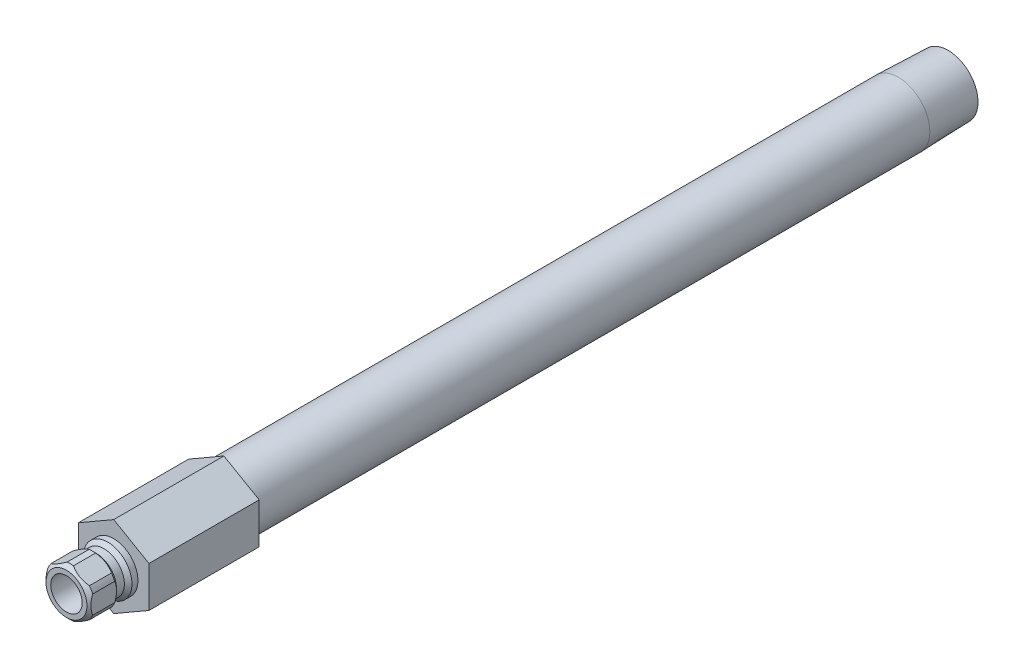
from build123d import *

# Parameters (mm, degrees)
SKETCH2_R           = 3.175
BOSS_EXTRUDE1_DEPTH = 22.225
CUT_EXTRUDE1_START  = 3.556
SKETCH3_OUTSIDE_W   = 52.048
SKETCH3_OUTSIDE_H   = 54.248
CUT_EXTRUDE1_DEPTH  = 166.069315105


with BuildPart() as part:
    # Sketch1 → Revolve1 (revolve)
    with BuildSketch(Plane(origin=(0, 0, 0), x_dir=(0, 0, -1), z_dir=(1, 0, 0))):
        Polygon((-9.525, 3.175), (-9.525, 4.1275), (-8.763, 4.8895), (-4.318, 4.8895), (-3.556, 4.1275), (-1.9685, 4.1275), (-1.2065, 4.8895), (0, 4.8895), (0, 6.35), (158.242, 6.35), (168.275, 6.036470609), (168.275, 4.6228), (22.225, 4.6228), (22.225, 3.175), align=None)
    revolve(axis=Axis((0, 0, 0), (0, 0, 1)))

    # Sketch2 → Boss-Extrude1 (add)
    with BuildSketch(Plane.XY):
        Polygon((-7.112, 4.106115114), (-7.112, -4.106115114), (0, -8.212230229), (7.112, -4.106115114), (7.112, 4.106115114), (0, 8.212230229), align=None)
        with Locations(Location((0, 0, 0), (0, 0, 90))):
            Circle(SKETCH2_R, mode=Mode.SUBTRACT)
    extrude(amount=-BOSS_EXTRUDE1_DEPTH)

    # Sketch3 outside → Cut-Extrude1 (cut, through all)
    with BuildSketch(Plane.XY.offset(CUT_EXTRUDE1_START)):
        Rectangle(SKETCH3_OUTSIDE_W, SKETCH3_OUTSIDE_H)
        Polygon((4.5212, -2.610316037), (4.5212, 2.610316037), (0, 5.220632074), (-4.5212, 2.610316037), (-4.5212, -2.610316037), (0, -5.220632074), align=None, mode=Mode.SUBTRACT)
    extrude(amount=CUT_EXTRUDE1_DEPTH, mode=Mode.SUBTRACT)


solid = part.part
